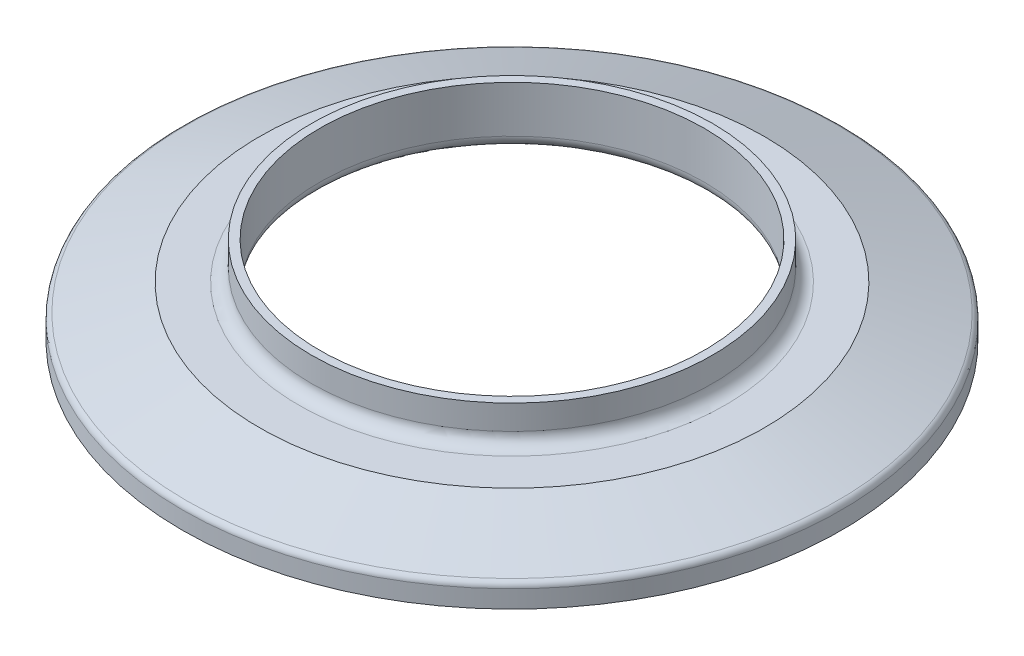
from build123d import *


with BuildPart() as part:
    # Sketch1 → Revolve1 (revolve)
    with BuildSketch(Plane.XY, mode=Mode.PRIVATE) as revolve1_sk:
        with BuildLine():
            Line((-73.406, 0), (-76.629558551, 0))
            ThreePointArc((-76.629558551, 0), (-76.90994254, 0.084386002), (-77.097175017, 0.309508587))
            Line((-77.097175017, 0.309508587), (-77.336301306, 0.872854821))
            ThreePointArc((-77.336301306, 0.872854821), (-78.4352, 1.6002), (-79.534098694, 0.872854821))
            Line((-79.534098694, 0.872854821), (-79.773224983, 0.309508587))
            ThreePointArc((-79.773224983, 0.309508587), (-79.96045746, 0.084386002), (-80.240841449, 0))
            Line((-80.240841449, 0), (-83.439, 0))
            Line((-83.439, 0), (-83.439, 4.467527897))
            ThreePointArc((-83.439, 4.467527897), (-83.149607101, 5.385364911), (-82.386100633, 5.971224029))
            Line((-82.386100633, 5.971224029), (-63.898940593, 12.7))
            Line((-63.898940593, 12.7), (-53.975, 12.7))
            ThreePointArc((-53.975, 12.7), (-51.72993597, 13.62993597), (-50.8, 15.875))
            Line((-50.8, 15.875), (-50.8, 22.098))
            Line((-50.8, 22.098), (-48.6918, 22.098))
            Line((-48.6918, 22.098), (-48.6918, 10.285233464))
            ThreePointArc((-48.6918, 10.285233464), (-49.300110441, 8.416348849), (-50.891944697, 7.263597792))
            Line((-50.891944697, 7.263597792), (-73.406, 0))
        make_face()
    revolve(revolve1_sk.sketch.rotate(Axis((0, 0, 0), (0, 1, 0)), 270), axis=Axis((0, 0, 0), (0, 1, 0)))


solid = part.part
